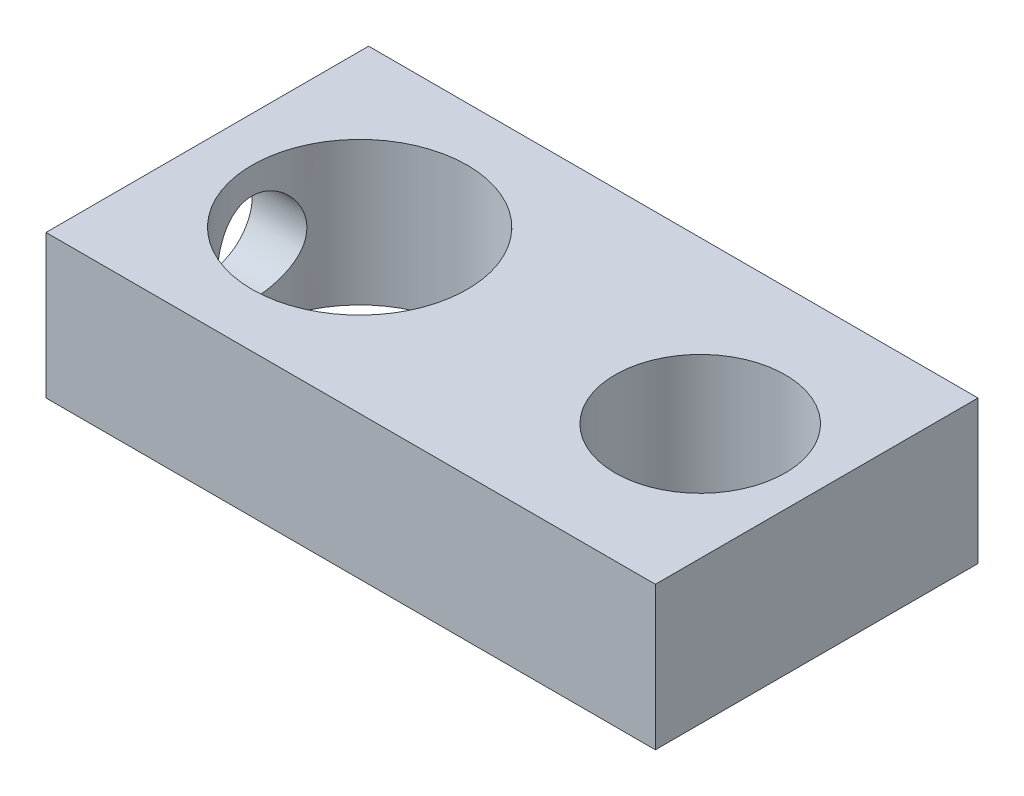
from build123d import *

# Parameters (mm, degrees)
SKETCH1_W          = 53.975
SKETCH1_H          = 28.575
SKETCH1_R          = 9.53262
SKETCH1_R_2        = 7.53618
BASE_EXTRUDE_DEPTH = 12.7
SKETCH2_R          = 3.9878
CUT_EXTRUDE1_DEPTH = 12.7


with BuildPart() as part:
    # Sketch1 → Base-Extrude (new body)
    with BuildSketch(Plane(origin=(0, 0, 0), x_dir=(1, 0, 0), z_dir=(0, 1, 0))):
        with Locations((13.49375, 0)):
            Rectangle(SKETCH1_W, SKETCH1_H)
        with Locations(Location((0, 0, 0), (0, 0, 270))):
            Circle(SKETCH1_R, mode=Mode.SUBTRACT)
        with Locations(Location((30.1625, 0, 0), (0, 0, 270))):
            Circle(SKETCH1_R_2, mode=Mode.SUBTRACT)
    extrude(amount=BASE_EXTRUDE_DEPTH)

    # Sketch2 → Cut-Extrude1 (cut)
    with BuildSketch(Plane.ZY.offset(13.49375)):
        with Locations((0, 6.35)):
            Circle(SKETCH2_R)
    extrude(amount=-CUT_EXTRUDE1_DEPTH, mode=Mode.SUBTRACT)


solid = part.part
